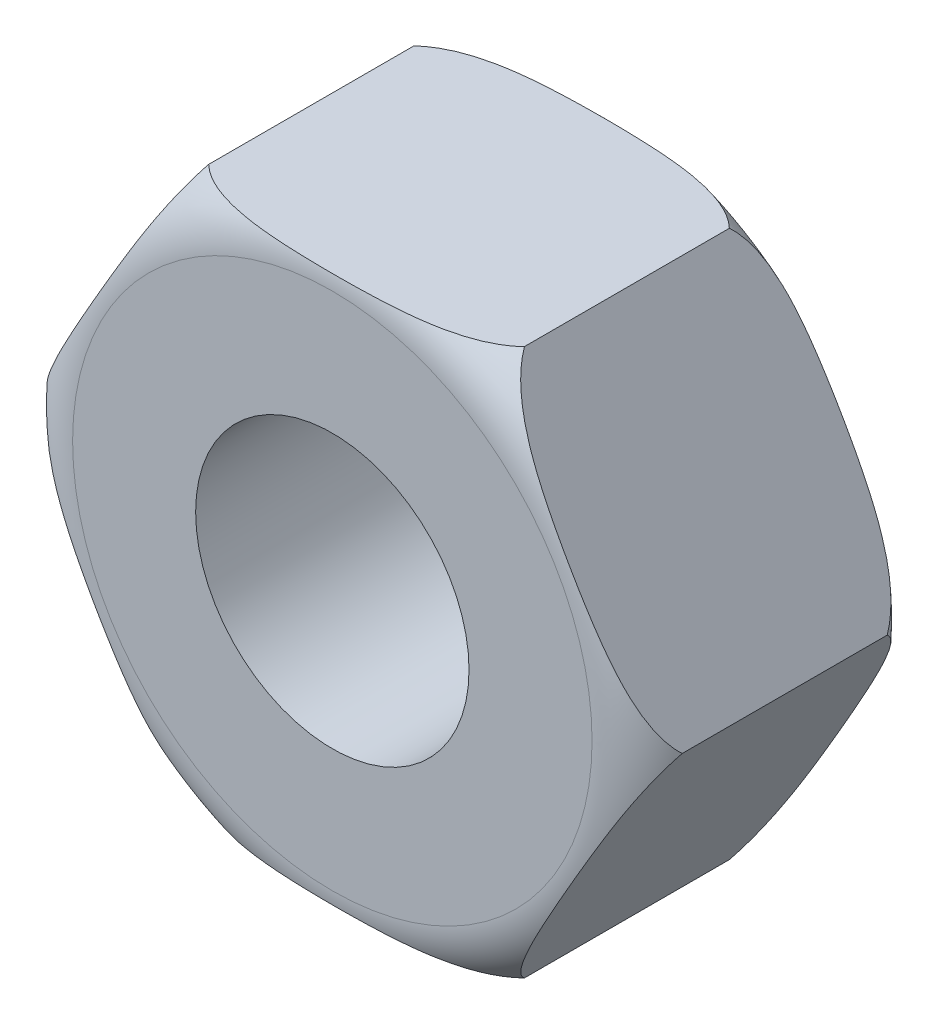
from build123d import *

# Parameters (mm, degrees)
ESQUISSE1_R             = 5.9
ESQUISSE1_R_2           = 2.5
EXTRUSION1_DEPTH        = 5
CONG_1_R                = 1.15
ESQUISSE2_OUTSIDE_W     = 17.284
ESQUISSE2_OUTSIDE_H     = 17.284
ENL_V_MAT_EXTRU_2_DEPTH = 6


with BuildPart() as part:
    # Esquisse1 → Extrusion1 (new body)
    with BuildSketch(Plane.XY):
        Circle(ESQUISSE1_R)
        Circle(ESQUISSE1_R_2, mode=Mode.SUBTRACT)
    extrude(amount=EXTRUSION1_DEPTH)

    # Cong_1
    cong_1_edges = [part.edges().sort_by_distance(p)[0] for p in [
        (-5.9, 0, 0),
        (-5.9, 0, 5),
    ]]
    fillet(cong_1_edges, radius=CONG_1_R)

    # Esquisse2 outside → Enl_v. mat.-Extru.2 (cut)
    with BuildSketch(Plane.XY):
        Rectangle(ESQUISSE2_OUTSIDE_W, ESQUISSE2_OUTSIDE_H)
        Polygon((2.886751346, 5), (-2.886751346, 5), (-5.773502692, 0), (-2.886751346, -5), (2.886751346, -5), (5.773502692, 0), align=None, mode=Mode.SUBTRACT)
    extrude(amount=ENL_V_MAT_EXTRU_2_DEPTH, mode=Mode.SUBTRACT)


solid = part.part
